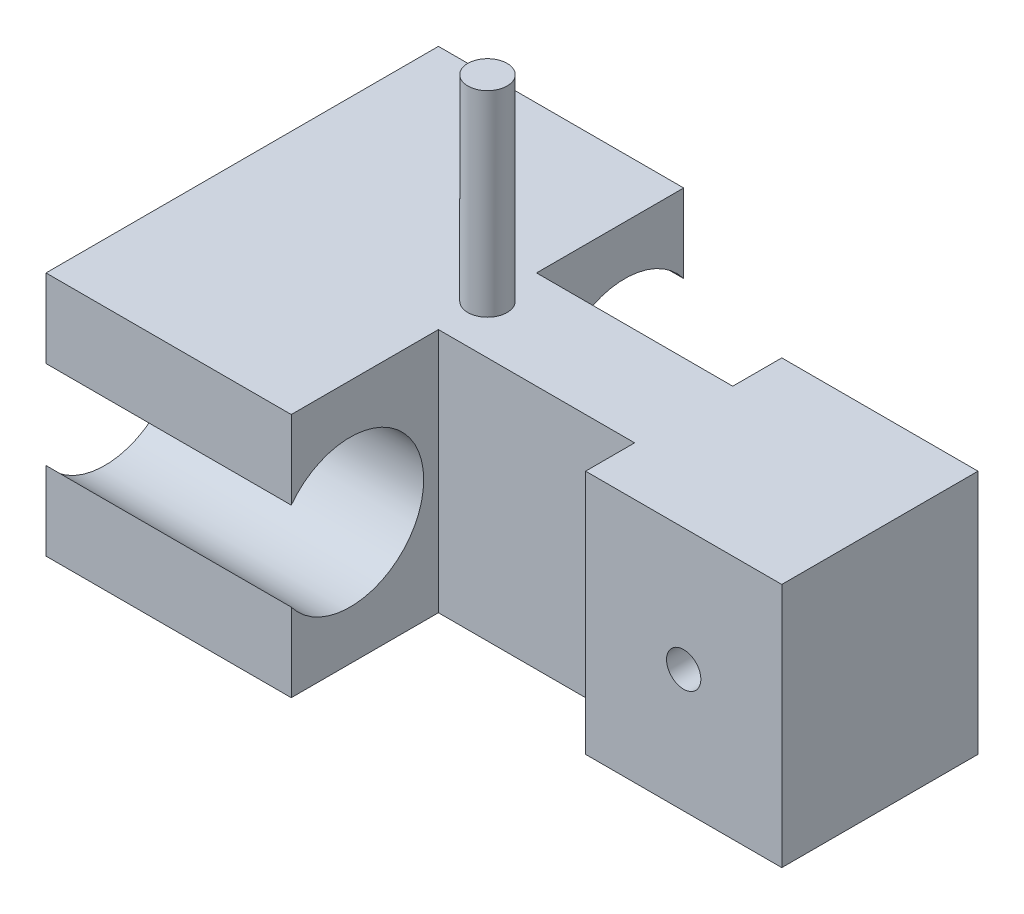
ISO-10303-21;
HEADER;
FILE_DESCRIPTION(('STEP AP214'),'2;1');
FILE_NAME('part.step','',(''),(''),'','','');
FILE_SCHEMA(('AUTOMOTIVE_DESIGN { 1 0 10303 214 1 1 1 1 }'));
ENDSEC;
DATA;
#1=APPLICATION_CONTEXT('core data for automotive mechanical design processes');
#2=APPLICATION_PROTOCOL_DEFINITION('international standard','automotive_design',2000,#1);
#3=PRODUCT_CONTEXT('',#1,'mechanical');
#4=PRODUCT('Part','Part','',(#3));
#5=PRODUCT_RELATED_PRODUCT_CATEGORY('part','',(#4));
#6=PRODUCT_DEFINITION_FORMATION('','',#4);
#7=PRODUCT_DEFINITION_CONTEXT('part definition',#1,'design');
#8=PRODUCT_DEFINITION('design','',#6,#7);
#9=PRODUCT_DEFINITION_SHAPE('','',#8);
#10=(LENGTH_UNIT() NAMED_UNIT(*) SI_UNIT(.MILLI.,.METRE.));
#11=(NAMED_UNIT(*) PLANE_ANGLE_UNIT() SI_UNIT($,.RADIAN.));
#12=(NAMED_UNIT(*) SI_UNIT($,.STERADIAN.) SOLID_ANGLE_UNIT());
#13=UNCERTAINTY_MEASURE_WITH_UNIT(LENGTH_MEASURE(1.E-05),#10,'distance_accuracy_value','');
#14=(GEOMETRIC_REPRESENTATION_CONTEXT(3) GLOBAL_UNCERTAINTY_ASSIGNED_CONTEXT((#13)) GLOBAL_UNIT_ASSIGNED_CONTEXT((#10,
#11,#12)) REPRESENTATION_CONTEXT('',''));
#15=CARTESIAN_POINT('',(0.,0.,0.));
#16=DIRECTION('',(0.,0.,1.));
#17=DIRECTION('',(1.,0.,0.));
#18=AXIS2_PLACEMENT_3D('',#15,#16,#17);
#19=CARTESIAN_POINT('',(0.,63.5,0.));
#20=DIRECTION('',(0.,-1.,0.));
#21=DIRECTION('',(0.,0.,-1.));
#22=AXIS2_PLACEMENT_3D('',#19,#20,#21);
#23=PLANE('',#22);
#24=DIRECTION('',(0.,0.,1.));
#25=VECTOR('',#24,1.);
#26=CARTESIAN_POINT('',(0.,63.5,0.));
#27=LINE('',#26,#25);
#28=CARTESIAN_POINT('',(0.,63.5,-50.8));
#29=VERTEX_POINT('',#28);
#30=CARTESIAN_POINT('',(0.,63.5,50.8));
#31=VERTEX_POINT('',#30);
#32=EDGE_CURVE('E176',#29,#31,#27,.T.);
#33=ORIENTED_EDGE('',*,*,#32,.T.);
#34=DIRECTION('',(-1.,0.,0.));
#35=VECTOR('',#34,1.);
#36=CARTESIAN_POINT('',(0.,63.5,50.8));
#37=LINE('',#36,#35);
#38=CARTESIAN_POINT('',(63.5,63.5,50.8));
#39=VERTEX_POINT('',#38);
#40=EDGE_CURVE('E240',#39,#31,#37,.T.);
#41=ORIENTED_EDGE('',*,*,#40,.F.);
#42=DIRECTION('',(0.,0.,1.));
#43=VECTOR('',#42,1.);
#44=CARTESIAN_POINT('',(63.5,63.5,50.8));
#45=LINE('',#44,#43);
#46=CARTESIAN_POINT('',(63.5,63.5,12.7));
#47=VERTEX_POINT('',#46);
#48=EDGE_CURVE('E166',#47,#39,#45,.T.);
#49=ORIENTED_EDGE('',*,*,#48,.F.);
#50=DIRECTION('',(-1.,0.,0.));
#51=VECTOR('',#50,1.);
#52=CARTESIAN_POINT('',(63.5,63.5,12.7));
#53=LINE('',#52,#51);
#54=CARTESIAN_POINT('',(114.3,63.5,12.7));
#55=VERTEX_POINT('',#54);
#56=EDGE_CURVE('E257',#55,#47,#53,.T.);
#57=ORIENTED_EDGE('',*,*,#56,.F.);
#58=DIRECTION('',(0.,0.,-1.));
#59=VECTOR('',#58,1.);
#60=CARTESIAN_POINT('',(114.3,63.5,12.7));
#61=LINE('',#60,#59);
#62=CARTESIAN_POINT('',(114.3,63.5,25.4));
#63=VERTEX_POINT('',#62);
#64=EDGE_CURVE('E260',#63,#55,#61,.T.);
#65=ORIENTED_EDGE('',*,*,#64,.F.);
#66=DIRECTION('',(-1.,0.,0.));
#67=VECTOR('',#66,1.);
#68=CARTESIAN_POINT('',(114.3,63.5,25.4));
#69=LINE('',#68,#67);
#70=CARTESIAN_POINT('',(165.1,63.5,25.4));
#71=VERTEX_POINT('',#70);
#72=EDGE_CURVE('E263',#71,#63,#69,.T.);
#73=ORIENTED_EDGE('',*,*,#72,.F.);
#74=DIRECTION('',(0.,0.,-1.));
#75=VECTOR('',#74,1.);
#76=CARTESIAN_POINT('',(165.1,63.5,-25.4));
#77=LINE('',#76,#75);
#78=CARTESIAN_POINT('',(165.1,63.5,-25.4));
#79=VERTEX_POINT('',#78);
#80=EDGE_CURVE('E178',#71,#79,#77,.T.);
#81=ORIENTED_EDGE('',*,*,#80,.T.);
#82=DIRECTION('',(-1.,0.,0.));
#83=VECTOR('',#82,1.);
#84=CARTESIAN_POINT('',(114.3,63.5,-25.4));
#85=LINE('',#84,#83);
#86=CARTESIAN_POINT('',(114.3,63.5,-25.4));
#87=VERTEX_POINT('',#86);
#88=EDGE_CURVE('E181',#79,#87,#85,.T.);
#89=ORIENTED_EDGE('',*,*,#88,.T.);
#90=DIRECTION('',(0.,0.,1.));
#91=VECTOR('',#90,1.);
#92=CARTESIAN_POINT('',(114.3,63.5,-12.7));
#93=LINE('',#92,#91);
#94=CARTESIAN_POINT('',(114.3,63.5,-12.7));
#95=VERTEX_POINT('',#94);
#96=EDGE_CURVE('E183',#87,#95,#93,.T.);
#97=ORIENTED_EDGE('',*,*,#96,.T.);
#98=DIRECTION('',(-1.,0.,0.));
#99=VECTOR('',#98,1.);
#100=CARTESIAN_POINT('',(63.5,63.5,-12.7));
#101=LINE('',#100,#99);
#102=CARTESIAN_POINT('',(63.5,63.5,-12.7));
#103=VERTEX_POINT('',#102);
#104=EDGE_CURVE('E185',#95,#103,#101,.T.);
#105=ORIENTED_EDGE('',*,*,#104,.T.);
#106=DIRECTION('',(0.,0.,-1.));
#107=VECTOR('',#106,1.);
#108=CARTESIAN_POINT('',(63.5,63.5,-50.8));
#109=LINE('',#108,#107);
#110=CARTESIAN_POINT('',(63.5,63.5,-50.8));
#111=VERTEX_POINT('',#110);
#112=EDGE_CURVE('E187',#103,#111,#109,.T.);
#113=ORIENTED_EDGE('',*,*,#112,.T.);
#114=DIRECTION('',(-1.,0.,0.));
#115=VECTOR('',#114,1.);
#116=CARTESIAN_POINT('',(0.,63.5,-50.8));
#117=LINE('',#116,#115);
#118=EDGE_CURVE('E189',#111,#29,#117,.T.);
#119=ORIENTED_EDGE('',*,*,#118,.T.);
#120=EDGE_LOOP('',(#33,#41,#49,#57,#65,#73,#81,#89,#97,#105,#113,#119));
#121=FACE_BOUND('',#120,.T.);
#122=CARTESIAN_POINT('',(63.5,63.5,0.));
#123=DIRECTION('',(0.,-1.,0.));
#124=DIRECTION('',(0.,0.,-1.));
#125=AXIS2_PLACEMENT_3D('',#122,#123,#124);
#126=CIRCLE('',#125,5.08);
#127=CARTESIAN_POINT('',(63.5,63.5,-5.08));
#128=VERTEX_POINT('',#127);
#129=EDGE_CURVE('E11',#128,#128,#126,.F.);
#130=ORIENTED_EDGE('',*,*,#129,.F.);
#131=EDGE_LOOP('',(#130));
#132=FACE_BOUND('',#131,.T.);
#133=ADVANCED_FACE('F33',(#121,#132),#23,.F.);
#134=CARTESIAN_POINT('',(0.,63.5,50.8));
#135=DIRECTION('',(0.,0.,1.));
#136=DIRECTION('',(1.,0.,0.));
#137=AXIS2_PLACEMENT_3D('',#134,#135,#136);
#138=PLANE('',#137);
#139=DIRECTION('',(-1.,0.,0.));
#140=VECTOR('',#139,1.);
#141=CARTESIAN_POINT('',(117.381536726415,43.18,50.8));
#142=LINE('',#141,#140);
#143=CARTESIAN_POINT('',(63.5,43.18,50.8));
#144=VERTEX_POINT('',#143);
#145=CARTESIAN_POINT('',(0.,43.18,50.8));
#146=VERTEX_POINT('',#145);
#147=EDGE_CURVE('E146',#144,#146,#142,.T.);
#148=ORIENTED_EDGE('',*,*,#147,.F.);
#149=DIRECTION('',(0.,-1.,0.));
#150=VECTOR('',#149,1.);
#151=CARTESIAN_POINT('',(63.5,63.5,50.8));
#152=LINE('',#151,#150);
#153=EDGE_CURVE('E157',#39,#144,#152,.T.);
#154=ORIENTED_EDGE('',*,*,#153,.F.);
#155=ORIENTED_EDGE('',*,*,#40,.T.);
#156=DIRECTION('',(0.,-1.,0.));
#157=VECTOR('',#156,1.);
#158=CARTESIAN_POINT('',(0.,63.5,50.8));
#159=LINE('',#158,#157);
#160=EDGE_CURVE('E160',#31,#146,#159,.T.);
#161=ORIENTED_EDGE('',*,*,#160,.T.);
#162=EDGE_LOOP('',(#148,#154,#155,#161));
#163=FACE_BOUND('',#162,.T.);
#164=ADVANCED_FACE('F155',(#163),#138,.T.);
#165=CARTESIAN_POINT('',(0.,63.5,-50.8));
#166=DIRECTION('',(0.,0.,1.));
#167=DIRECTION('',(1.,0.,0.));
#168=AXIS2_PLACEMENT_3D('',#165,#166,#167);
#169=PLANE('',#168);
#170=DIRECTION('',(0.,-1.,0.));
#171=VECTOR('',#170,1.);
#172=CARTESIAN_POINT('',(63.5,63.5,-50.8));
#173=LINE('',#172,#171);
#174=CARTESIAN_POINT('',(63.5,43.18,-50.8));
#175=VERTEX_POINT('',#174);
#176=EDGE_CURVE('E211',#111,#175,#173,.T.);
#177=ORIENTED_EDGE('',*,*,#176,.T.);
#178=DIRECTION('',(-1.,0.,0.));
#179=VECTOR('',#178,1.);
#180=CARTESIAN_POINT('',(117.381536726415,43.18,-50.8));
#181=LINE('',#180,#179);
#182=CARTESIAN_POINT('',(0.,43.18,-50.8));
#183=VERTEX_POINT('',#182);
#184=EDGE_CURVE('E41',#175,#183,#181,.T.);
#185=ORIENTED_EDGE('',*,*,#184,.T.);
#186=DIRECTION('',(0.,-1.,0.));
#187=VECTOR('',#186,1.);
#188=CARTESIAN_POINT('',(0.,63.5,-50.8));
#189=LINE('',#188,#187);
#190=EDGE_CURVE('E207',#29,#183,#189,.T.);
#191=ORIENTED_EDGE('',*,*,#190,.F.);
#192=ORIENTED_EDGE('',*,*,#118,.F.);
#193=EDGE_LOOP('',(#177,#185,#191,#192));
#194=FACE_BOUND('',#193,.T.);
#195=ADVANCED_FACE('F230',(#194),#169,.F.);
#196=CARTESIAN_POINT('',(0.,63.5,0.));
#197=DIRECTION('',(1.,0.,0.));
#198=DIRECTION('',(0.,0.,-1.));
#199=AXIS2_PLACEMENT_3D('',#196,#197,#198);
#200=PLANE('',#199);
#201=CARTESIAN_POINT('',(0.,20.32,50.8));
#202=VERTEX_POINT('',#201);
#203=CARTESIAN_POINT('',(0.,0.,50.8));
#204=VERTEX_POINT('',#203);
#205=EDGE_CURVE('E167',#202,#204,#159,.T.);
#206=ORIENTED_EDGE('',*,*,#205,.F.);
#207=CARTESIAN_POINT('',(0.,31.75,35.56));
#208=DIRECTION('',(-1.,0.,0.));
#209=DIRECTION('',(0.,0.,-1.));
#210=AXIS2_PLACEMENT_3D('',#207,#208,#209);
#211=CIRCLE('',#210,19.05);
#212=EDGE_CURVE('E151',#146,#202,#211,.T.);
#213=ORIENTED_EDGE('',*,*,#212,.F.);
#214=ORIENTED_EDGE('',*,*,#160,.F.);
#215=ORIENTED_EDGE('',*,*,#32,.F.);
#216=ORIENTED_EDGE('',*,*,#190,.T.);
#217=CARTESIAN_POINT('',(0.,31.75,-35.56));
#218=DIRECTION('',(-1.,0.,0.));
#219=DIRECTION('',(0.,0.,1.));
#220=AXIS2_PLACEMENT_3D('',#217,#218,#219);
#221=CIRCLE('',#220,19.05);
#222=CARTESIAN_POINT('',(0.,20.32,-50.8));
#223=VERTEX_POINT('',#222);
#224=EDGE_CURVE('E161',#223,#183,#221,.T.);
#225=ORIENTED_EDGE('',*,*,#224,.F.);
#226=CARTESIAN_POINT('',(0.,0.,-50.8));
#227=VERTEX_POINT('',#226);
#228=EDGE_CURVE('E191',#223,#227,#189,.T.);
#229=ORIENTED_EDGE('',*,*,#228,.T.);
#230=DIRECTION('',(0.,0.,1.));
#231=VECTOR('',#230,1.);
#232=CARTESIAN_POINT('',(0.,0.,0.));
#233=LINE('',#232,#231);
#234=EDGE_CURVE('E175',#227,#204,#233,.T.);
#235=ORIENTED_EDGE('',*,*,#234,.T.);
#236=EDGE_LOOP('',(#206,#213,#214,#215,#216,#225,#229,#235));
#237=FACE_BOUND('',#236,.T.);
#238=ADVANCED_FACE('F35',(#237),#200,.F.);
#239=CARTESIAN_POINT('',(165.1,63.5,-25.4));
#240=DIRECTION('',(-1.,0.,0.));
#241=DIRECTION('',(0.,0.,1.));
#242=AXIS2_PLACEMENT_3D('',#239,#240,#241);
#243=PLANE('',#242);
#244=DIRECTION('',(0.,0.,-1.));
#245=VECTOR('',#244,1.);
#246=CARTESIAN_POINT('',(165.1,0.,-25.4));
#247=LINE('',#246,#245);
#248=CARTESIAN_POINT('',(165.1,0.,25.4));
#249=VERTEX_POINT('',#248);
#250=CARTESIAN_POINT('',(165.1,0.,-25.4));
#251=VERTEX_POINT('',#250);
#252=EDGE_CURVE('E194',#249,#251,#247,.T.);
#253=ORIENTED_EDGE('',*,*,#252,.T.);
#254=DIRECTION('',(0.,-1.,0.));
#255=VECTOR('',#254,1.);
#256=CARTESIAN_POINT('',(165.1,63.5,-25.4));
#257=LINE('',#256,#255);
#258=EDGE_CURVE('E223',#79,#251,#257,.T.);
#259=ORIENTED_EDGE('',*,*,#258,.F.);
#260=ORIENTED_EDGE('',*,*,#80,.F.);
#261=DIRECTION('',(0.,-1.,0.));
#262=VECTOR('',#261,1.);
#263=CARTESIAN_POINT('',(165.1,63.5,25.4));
#264=LINE('',#263,#262);
#265=EDGE_CURVE('E265',#71,#249,#264,.T.);
#266=ORIENTED_EDGE('',*,*,#265,.T.);
#267=EDGE_LOOP('',(#253,#259,#260,#266));
#268=FACE_BOUND('',#267,.T.);
#269=ADVANCED_FACE('F300',(#268),#243,.F.);
#270=CARTESIAN_POINT('',(114.3,63.5,-25.4));
#271=DIRECTION('',(0.,0.,1.));
#272=DIRECTION('',(1.,0.,0.));
#273=AXIS2_PLACEMENT_3D('',#270,#271,#272);
#274=PLANE('',#273);
#275=CARTESIAN_POINT('',(139.7,31.75,-25.4));
#276=DIRECTION('',(0.,0.,-1.));
#277=DIRECTION('',(-1.,0.,0.));
#278=AXIS2_PLACEMENT_3D('',#275,#276,#277);
#279=CIRCLE('',#278,4.445);
#280=CARTESIAN_POINT('',(135.255,31.75,-25.4));
#281=VERTEX_POINT('',#280);
#282=EDGE_CURVE('E467',#281,#281,#279,.T.);
#283=ORIENTED_EDGE('',*,*,#282,.F.);
#284=EDGE_LOOP('',(#283));
#285=FACE_BOUND('',#284,.T.);
#286=DIRECTION('',(-1.,0.,0.));
#287=VECTOR('',#286,1.);
#288=CARTESIAN_POINT('',(114.3,0.,-25.4));
#289=LINE('',#288,#287);
#290=CARTESIAN_POINT('',(114.3,0.,-25.4));
#291=VERTEX_POINT('',#290);
#292=EDGE_CURVE('E196',#251,#291,#289,.T.);
#293=ORIENTED_EDGE('',*,*,#292,.T.);
#294=DIRECTION('',(0.,-1.,0.));
#295=VECTOR('',#294,1.);
#296=CARTESIAN_POINT('',(114.3,63.5,-25.4));
#297=LINE('',#296,#295);
#298=EDGE_CURVE('E220',#87,#291,#297,.T.);
#299=ORIENTED_EDGE('',*,*,#298,.F.);
#300=ORIENTED_EDGE('',*,*,#88,.F.);
#301=ORIENTED_EDGE('',*,*,#258,.T.);
#302=EDGE_LOOP('',(#293,#299,#300,#301));
#303=FACE_BOUND('',#302,.T.);
#304=ADVANCED_FACE('F307',(#285,#303),#274,.F.);
#305=CARTESIAN_POINT('',(114.3,63.5,-12.7));
#306=DIRECTION('',(1.,0.,0.));
#307=DIRECTION('',(0.,0.,-1.));
#308=AXIS2_PLACEMENT_3D('',#305,#306,#307);
#309=PLANE('',#308);
#310=DIRECTION('',(0.,0.,1.));
#311=VECTOR('',#310,1.);
#312=CARTESIAN_POINT('',(114.3,0.,-12.7));
#313=LINE('',#312,#311);
#314=CARTESIAN_POINT('',(114.3,0.,-12.7));
#315=VERTEX_POINT('',#314);
#316=EDGE_CURVE('E198',#291,#315,#313,.T.);
#317=ORIENTED_EDGE('',*,*,#316,.T.);
#318=DIRECTION('',(0.,-1.,0.));
#319=VECTOR('',#318,1.);
#320=CARTESIAN_POINT('',(114.3,63.5,-12.7));
#321=LINE('',#320,#319);
#322=EDGE_CURVE('E217',#95,#315,#321,.T.);
#323=ORIENTED_EDGE('',*,*,#322,.F.);
#324=ORIENTED_EDGE('',*,*,#96,.F.);
#325=ORIENTED_EDGE('',*,*,#298,.T.);
#326=EDGE_LOOP('',(#317,#323,#324,#325));
#327=FACE_BOUND('',#326,.T.);
#328=ADVANCED_FACE('F311',(#327),#309,.F.);
#329=CARTESIAN_POINT('',(63.5,63.5,-12.7));
#330=DIRECTION('',(0.,0.,1.));
#331=DIRECTION('',(1.,0.,0.));
#332=AXIS2_PLACEMENT_3D('',#329,#330,#331);
#333=PLANE('',#332);
#334=DIRECTION('',(-1.,0.,0.));
#335=VECTOR('',#334,1.);
#336=CARTESIAN_POINT('',(63.5,0.,-12.7));
#337=LINE('',#336,#335);
#338=CARTESIAN_POINT('',(63.5,0.,-12.7));
#339=VERTEX_POINT('',#338);
#340=EDGE_CURVE('E200',#315,#339,#337,.T.);
#341=ORIENTED_EDGE('',*,*,#340,.T.);
#342=DIRECTION('',(0.,-1.,0.));
#343=VECTOR('',#342,1.);
#344=CARTESIAN_POINT('',(63.5,63.5,-12.7));
#345=LINE('',#344,#343);
#346=EDGE_CURVE('E214',#103,#339,#345,.T.);
#347=ORIENTED_EDGE('',*,*,#346,.F.);
#348=ORIENTED_EDGE('',*,*,#104,.F.);
#349=ORIENTED_EDGE('',*,*,#322,.T.);
#350=EDGE_LOOP('',(#341,#347,#348,#349));
#351=FACE_BOUND('',#350,.T.);
#352=ADVANCED_FACE('F314',(#351),#333,.F.);
#353=CARTESIAN_POINT('',(63.5,63.5,-50.8));
#354=DIRECTION('',(-1.,0.,0.));
#355=DIRECTION('',(0.,0.,1.));
#356=AXIS2_PLACEMENT_3D('',#353,#354,#355);
#357=PLANE('',#356);
#358=CARTESIAN_POINT('',(63.5,20.32,-50.8));
#359=VERTEX_POINT('',#358);
#360=CARTESIAN_POINT('',(63.5,0.,-50.8));
#361=VERTEX_POINT('',#360);
#362=EDGE_CURVE('E210',#359,#361,#173,.T.);
#363=ORIENTED_EDGE('',*,*,#362,.F.);
#364=CARTESIAN_POINT('',(63.5,31.75,-35.56));
#365=DIRECTION('',(-1.,0.,0.));
#366=DIRECTION('',(0.,0.,1.));
#367=AXIS2_PLACEMENT_3D('',#364,#365,#366);
#368=CIRCLE('',#367,19.05);
#369=EDGE_CURVE('E56',#175,#359,#368,.F.);
#370=ORIENTED_EDGE('',*,*,#369,.F.);
#371=ORIENTED_EDGE('',*,*,#176,.F.);
#372=ORIENTED_EDGE('',*,*,#112,.F.);
#373=ORIENTED_EDGE('',*,*,#346,.T.);
#374=DIRECTION('',(0.,0.,-1.));
#375=VECTOR('',#374,1.);
#376=CARTESIAN_POINT('',(63.5,0.,-50.8));
#377=LINE('',#376,#375);
#378=EDGE_CURVE('E202',#339,#361,#377,.T.);
#379=ORIENTED_EDGE('',*,*,#378,.T.);
#380=EDGE_LOOP('',(#363,#370,#371,#372,#373,#379));
#381=FACE_BOUND('',#380,.T.);
#382=ADVANCED_FACE('F246',(#381),#357,.F.);
#383=ORIENTED_EDGE('',*,*,#228,.F.);
#384=DIRECTION('',(-1.,0.,0.));
#385=VECTOR('',#384,1.);
#386=CARTESIAN_POINT('',(117.381536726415,20.32,-50.8));
#387=LINE('',#386,#385);
#388=EDGE_CURVE('E226',#223,#359,#387,.F.);
#389=ORIENTED_EDGE('',*,*,#388,.T.);
#390=ORIENTED_EDGE('',*,*,#362,.T.);
#391=DIRECTION('',(-1.,0.,0.));
#392=VECTOR('',#391,1.);
#393=CARTESIAN_POINT('',(0.,0.,-50.8));
#394=LINE('',#393,#392);
#395=EDGE_CURVE('E179',#361,#227,#394,.T.);
#396=ORIENTED_EDGE('',*,*,#395,.T.);
#397=EDGE_LOOP('',(#383,#389,#390,#396));
#398=FACE_BOUND('',#397,.T.);
#399=ADVANCED_FACE('F318',(#398),#169,.F.);
#400=CARTESIAN_POINT('',(0.,0.,0.));
#401=DIRECTION('',(0.,-1.,0.));
#402=DIRECTION('',(0.,0.,-1.));
#403=AXIS2_PLACEMENT_3D('',#400,#401,#402);
#404=PLANE('',#403);
#405=ORIENTED_EDGE('',*,*,#234,.F.);
#406=ORIENTED_EDGE('',*,*,#395,.F.);
#407=ORIENTED_EDGE('',*,*,#378,.F.);
#408=ORIENTED_EDGE('',*,*,#340,.F.);
#409=ORIENTED_EDGE('',*,*,#316,.F.);
#410=ORIENTED_EDGE('',*,*,#292,.F.);
#411=ORIENTED_EDGE('',*,*,#252,.F.);
#412=DIRECTION('',(-1.,0.,0.));
#413=VECTOR('',#412,1.);
#414=CARTESIAN_POINT('',(114.3,0.,25.4));
#415=LINE('',#414,#413);
#416=CARTESIAN_POINT('',(114.3,0.,25.4));
#417=VERTEX_POINT('',#416);
#418=EDGE_CURVE('E255',#249,#417,#415,.T.);
#419=ORIENTED_EDGE('',*,*,#418,.T.);
#420=DIRECTION('',(0.,0.,-1.));
#421=VECTOR('',#420,1.);
#422=CARTESIAN_POINT('',(114.3,0.,12.7));
#423=LINE('',#422,#421);
#424=CARTESIAN_POINT('',(114.3,0.,12.7));
#425=VERTEX_POINT('',#424);
#426=EDGE_CURVE('E272',#417,#425,#423,.T.);
#427=ORIENTED_EDGE('',*,*,#426,.T.);
#428=DIRECTION('',(-1.,0.,0.));
#429=VECTOR('',#428,1.);
#430=CARTESIAN_POINT('',(63.5,0.,12.7));
#431=LINE('',#430,#429);
#432=CARTESIAN_POINT('',(63.5,0.,12.7));
#433=VERTEX_POINT('',#432);
#434=EDGE_CURVE('E269',#425,#433,#431,.T.);
#435=ORIENTED_EDGE('',*,*,#434,.T.);
#436=DIRECTION('',(0.,0.,1.));
#437=VECTOR('',#436,1.);
#438=CARTESIAN_POINT('',(63.5,0.,50.8));
#439=LINE('',#438,#437);
#440=CARTESIAN_POINT('',(63.5,0.,50.8));
#441=VERTEX_POINT('',#440);
#442=EDGE_CURVE('E250',#433,#441,#439,.T.);
#443=ORIENTED_EDGE('',*,*,#442,.T.);
#444=DIRECTION('',(-1.,0.,0.));
#445=VECTOR('',#444,1.);
#446=CARTESIAN_POINT('',(0.,0.,50.8));
#447=LINE('',#446,#445);
#448=EDGE_CURVE('E247',#441,#204,#447,.T.);
#449=ORIENTED_EDGE('',*,*,#448,.T.);
#450=EDGE_LOOP('',(#405,#406,#407,#408,#409,#410,#411,#419,#427,#435,#443,#449));
#451=FACE_BOUND('',#450,.T.);
#452=ADVANCED_FACE('F291',(#451),#404,.T.);
#453=DIRECTION('',(-1.,0.,0.));
#454=VECTOR('',#453,1.);
#455=CARTESIAN_POINT('',(117.381536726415,20.32,50.8));
#456=LINE('',#455,#454);
#457=CARTESIAN_POINT('',(63.5,20.32,50.8));
#458=VERTEX_POINT('',#457);
#459=EDGE_CURVE('E48',#202,#458,#456,.F.);
#460=ORIENTED_EDGE('',*,*,#459,.F.);
#461=ORIENTED_EDGE('',*,*,#205,.T.);
#462=ORIENTED_EDGE('',*,*,#448,.F.);
#463=EDGE_CURVE('E168',#458,#441,#152,.T.);
#464=ORIENTED_EDGE('',*,*,#463,.F.);
#465=EDGE_LOOP('',(#460,#461,#462,#464));
#466=FACE_BOUND('',#465,.T.);
#467=ADVANCED_FACE('F336',(#466),#138,.T.);
#468=CARTESIAN_POINT('',(63.5,63.5,50.8));
#469=DIRECTION('',(1.,0.,0.));
#470=DIRECTION('',(0.,0.,-1.));
#471=AXIS2_PLACEMENT_3D('',#468,#469,#470);
#472=PLANE('',#471);
#473=CARTESIAN_POINT('',(63.5,31.75,35.56));
#474=DIRECTION('',(-1.,0.,0.));
#475=DIRECTION('',(0.,0.,1.));
#476=AXIS2_PLACEMENT_3D('',#473,#474,#475);
#477=CIRCLE('',#476,19.05);
#478=EDGE_CURVE('E143',#458,#144,#477,.F.);
#479=ORIENTED_EDGE('',*,*,#478,.F.);
#480=ORIENTED_EDGE('',*,*,#463,.T.);
#481=ORIENTED_EDGE('',*,*,#442,.F.);
#482=DIRECTION('',(0.,-1.,0.));
#483=VECTOR('',#482,1.);
#484=CARTESIAN_POINT('',(63.5,63.5,12.7));
#485=LINE('',#484,#483);
#486=EDGE_CURVE('E171',#47,#433,#485,.T.);
#487=ORIENTED_EDGE('',*,*,#486,.F.);
#488=ORIENTED_EDGE('',*,*,#48,.T.);
#489=ORIENTED_EDGE('',*,*,#153,.T.);
#490=EDGE_LOOP('',(#479,#480,#481,#487,#488,#489));
#491=FACE_BOUND('',#490,.T.);
#492=ADVANCED_FACE('F164',(#491),#472,.T.);
#493=CARTESIAN_POINT('',(63.5,63.5,12.7));
#494=DIRECTION('',(0.,0.,1.));
#495=DIRECTION('',(1.,0.,0.));
#496=AXIS2_PLACEMENT_3D('',#493,#494,#495);
#497=PLANE('',#496);
#498=ORIENTED_EDGE('',*,*,#434,.F.);
#499=DIRECTION('',(0.,-1.,0.));
#500=VECTOR('',#499,1.);
#501=CARTESIAN_POINT('',(114.3,63.5,12.7));
#502=LINE('',#501,#500);
#503=EDGE_CURVE('E280',#55,#425,#502,.T.);
#504=ORIENTED_EDGE('',*,*,#503,.F.);
#505=ORIENTED_EDGE('',*,*,#56,.T.);
#506=ORIENTED_EDGE('',*,*,#486,.T.);
#507=EDGE_LOOP('',(#498,#504,#505,#506));
#508=FACE_BOUND('',#507,.T.);
#509=ADVANCED_FACE('F286',(#508),#497,.T.);
#510=CARTESIAN_POINT('',(114.3,63.5,12.7));
#511=DIRECTION('',(-1.,0.,0.));
#512=DIRECTION('',(0.,0.,1.));
#513=AXIS2_PLACEMENT_3D('',#510,#511,#512);
#514=PLANE('',#513);
#515=ORIENTED_EDGE('',*,*,#426,.F.);
#516=DIRECTION('',(0.,-1.,0.));
#517=VECTOR('',#516,1.);
#518=CARTESIAN_POINT('',(114.3,63.5,25.4));
#519=LINE('',#518,#517);
#520=EDGE_CURVE('E279',#63,#417,#519,.T.);
#521=ORIENTED_EDGE('',*,*,#520,.F.);
#522=ORIENTED_EDGE('',*,*,#64,.T.);
#523=ORIENTED_EDGE('',*,*,#503,.T.);
#524=EDGE_LOOP('',(#515,#521,#522,#523));
#525=FACE_BOUND('',#524,.T.);
#526=ADVANCED_FACE('F293',(#525),#514,.T.);
#527=CARTESIAN_POINT('',(114.3,63.5,25.4));
#528=DIRECTION('',(0.,0.,1.));
#529=DIRECTION('',(1.,0.,0.));
#530=AXIS2_PLACEMENT_3D('',#527,#528,#529);
#531=PLANE('',#530);
#532=CARTESIAN_POINT('',(139.7,31.75,25.4));
#533=DIRECTION('',(0.,0.,1.));
#534=DIRECTION('',(1.,0.,0.));
#535=AXIS2_PLACEMENT_3D('',#532,#533,#534);
#536=CIRCLE('',#535,4.445);
#537=CARTESIAN_POINT('',(144.145,31.75,25.4));
#538=VERTEX_POINT('',#537);
#539=EDGE_CURVE('E470',#538,#538,#536,.F.);
#540=ORIENTED_EDGE('',*,*,#539,.T.);
#541=EDGE_LOOP('',(#540));
#542=FACE_BOUND('',#541,.T.);
#543=ORIENTED_EDGE('',*,*,#418,.F.);
#544=ORIENTED_EDGE('',*,*,#265,.F.);
#545=ORIENTED_EDGE('',*,*,#72,.T.);
#546=ORIENTED_EDGE('',*,*,#520,.T.);
#547=EDGE_LOOP('',(#543,#544,#545,#546));
#548=FACE_BOUND('',#547,.T.);
#549=ADVANCED_FACE('F298',(#542,#548),#531,.T.);
#550=CARTESIAN_POINT('',(117.381536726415,31.75,-35.56));
#551=DIRECTION('',(-1.,0.,0.));
#552=DIRECTION('',(0.,0.,1.));
#553=AXIS2_PLACEMENT_3D('',#550,#551,#552);
#554=CYLINDRICAL_SURFACE('',#553,19.05);
#555=ORIENTED_EDGE('',*,*,#369,.T.);
#556=ORIENTED_EDGE('',*,*,#388,.F.);
#557=ORIENTED_EDGE('',*,*,#224,.T.);
#558=ORIENTED_EDGE('',*,*,#184,.F.);
#559=EDGE_LOOP('',(#555,#556,#557,#558));
#560=FACE_BOUND('',#559,.T.);
#561=ADVANCED_FACE('F319',(#560),#554,.F.);
#562=CARTESIAN_POINT('',(117.381536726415,31.75,35.56));
#563=DIRECTION('',(-1.,0.,0.));
#564=DIRECTION('',(0.,0.,1.));
#565=AXIS2_PLACEMENT_3D('',#562,#563,#564);
#566=CYLINDRICAL_SURFACE('',#565,19.05);
#567=ORIENTED_EDGE('',*,*,#147,.T.);
#568=ORIENTED_EDGE('',*,*,#212,.T.);
#569=ORIENTED_EDGE('',*,*,#459,.T.);
#570=ORIENTED_EDGE('',*,*,#478,.T.);
#571=EDGE_LOOP('',(#567,#568,#569,#570));
#572=FACE_BOUND('',#571,.T.);
#573=ADVANCED_FACE('F145',(#572),#566,.F.);
#574=CARTESIAN_POINT('',(139.7,31.75,37.9723585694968));
#575=DIRECTION('',(0.,0.,-1.));
#576=DIRECTION('',(-1.,0.,0.));
#577=AXIS2_PLACEMENT_3D('',#574,#575,#576);
#578=CYLINDRICAL_SURFACE('',#577,4.445);
#579=ORIENTED_EDGE('',*,*,#282,.T.);
#580=EDGE_LOOP('',(#579));
#581=FACE_BOUND('',#580,.T.);
#582=ORIENTED_EDGE('',*,*,#539,.F.);
#583=EDGE_LOOP('',(#582));
#584=FACE_BOUND('',#583,.T.);
#585=ADVANCED_FACE('F326',(#581,#584),#578,.F.);
#586=CARTESIAN_POINT('',(63.5,114.3,0.));
#587=DIRECTION('',(0.,-1.,0.));
#588=DIRECTION('',(0.,0.,-1.));
#589=AXIS2_PLACEMENT_3D('',#586,#587,#588);
#590=CYLINDRICAL_SURFACE('',#589,5.08);
#591=CARTESIAN_POINT('',(63.5,114.3,0.));
#592=DIRECTION('',(0.,1.,0.));
#593=DIRECTION('',(0.,0.,1.));
#594=AXIS2_PLACEMENT_3D('',#591,#592,#593);
#595=CIRCLE('',#594,5.08);
#596=CARTESIAN_POINT('',(63.5,114.3,5.08));
#597=VERTEX_POINT('',#596);
#598=EDGE_CURVE('E466',#597,#597,#595,.T.);
#599=ORIENTED_EDGE('',*,*,#598,.F.);
#600=EDGE_LOOP('',(#599));
#601=FACE_BOUND('',#600,.T.);
#602=ORIENTED_EDGE('',*,*,#129,.T.);
#603=EDGE_LOOP('',(#602));
#604=FACE_BOUND('',#603,.T.);
#605=ADVANCED_FACE('F434',(#601,#604),#590,.T.);
#606=CARTESIAN_POINT('',(63.5,114.3,0.));
#607=DIRECTION('',(0.,1.,0.));
#608=DIRECTION('',(0.,0.,1.));
#609=AXIS2_PLACEMENT_3D('',#606,#607,#608);
#610=PLANE('',#609);
#611=ORIENTED_EDGE('',*,*,#598,.T.);
#612=EDGE_LOOP('',(#611));
#613=FACE_BOUND('',#612,.T.);
#614=ADVANCED_FACE('F450',(#613),#610,.T.);
#615=CLOSED_SHELL('',(#133,#164,#195,#238,#269,#304,#328,#352,#382,#399,#452,#467,#492,#509,
#526,#549,#561,#573,#585,#605,#614));
#616=MANIFOLD_SOLID_BREP('B2',#615);
#617=ADVANCED_BREP_SHAPE_REPRESENTATION('',(#18,#616),#14);
#618=SHAPE_DEFINITION_REPRESENTATION(#9,#617);
ENDSEC;
END-ISO-10303-21;
